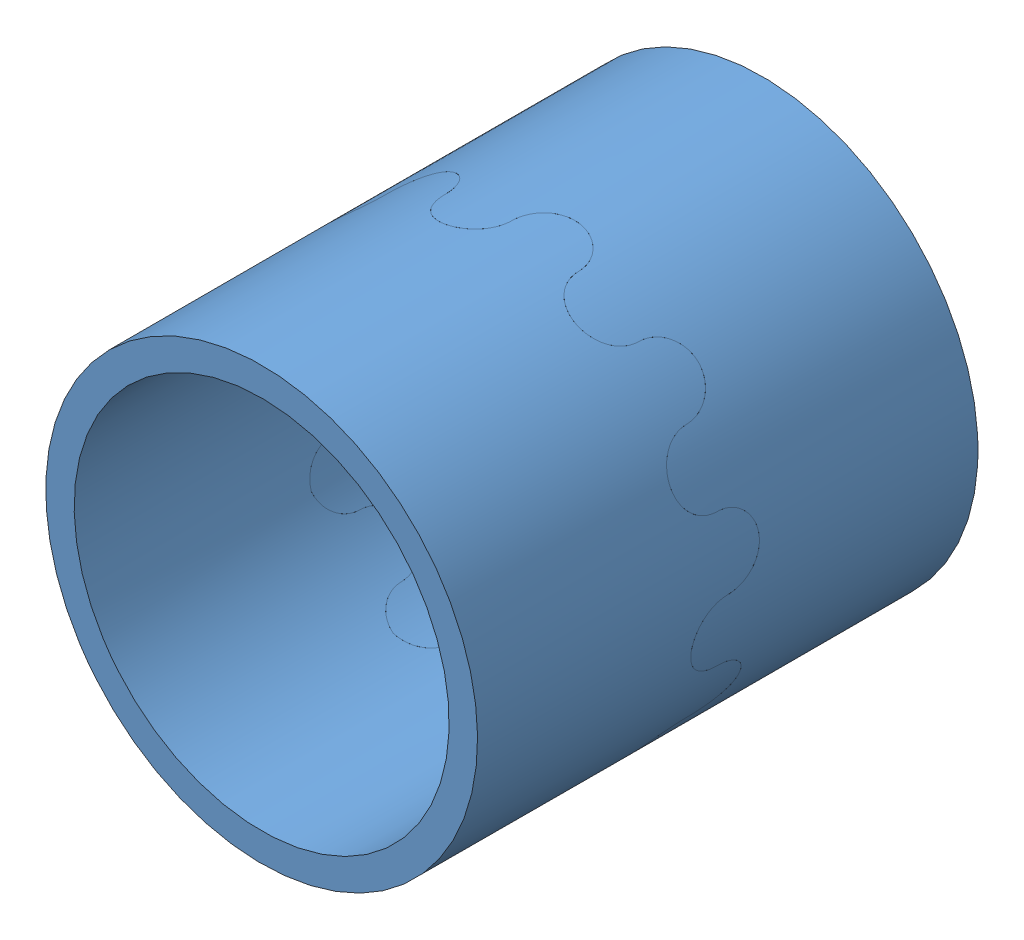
SolidWorks assembly Krone_test.SLDASM, configuration Standard (file format 3400). Lengths in mm.
Overall size (10.62 10.62 8.81).
2 component instances, 1 part files, 2 mates.
Components (placement in the parent):
- Krone_test-1: Krone_test.SLDPRT [Standard] at (25.8967 12.2447 -2.5169) size (7.6 7.6 5.03)
- Krone_test-2: Krone_test.SLDPRT [Standard] at (25.8967 12.2447 6.2893) x (-0.809017 -0.587785 0) z (0 0 -1) size (7.6 7.6 5.03)
Mates (geometry in assembly coordinates):
- Konzentrisch1: concentric: cylinder of ?; cylinder of ?
- Konzentrisch2: concentric anti-aligned: cylinder of ?; cylinder of ?
